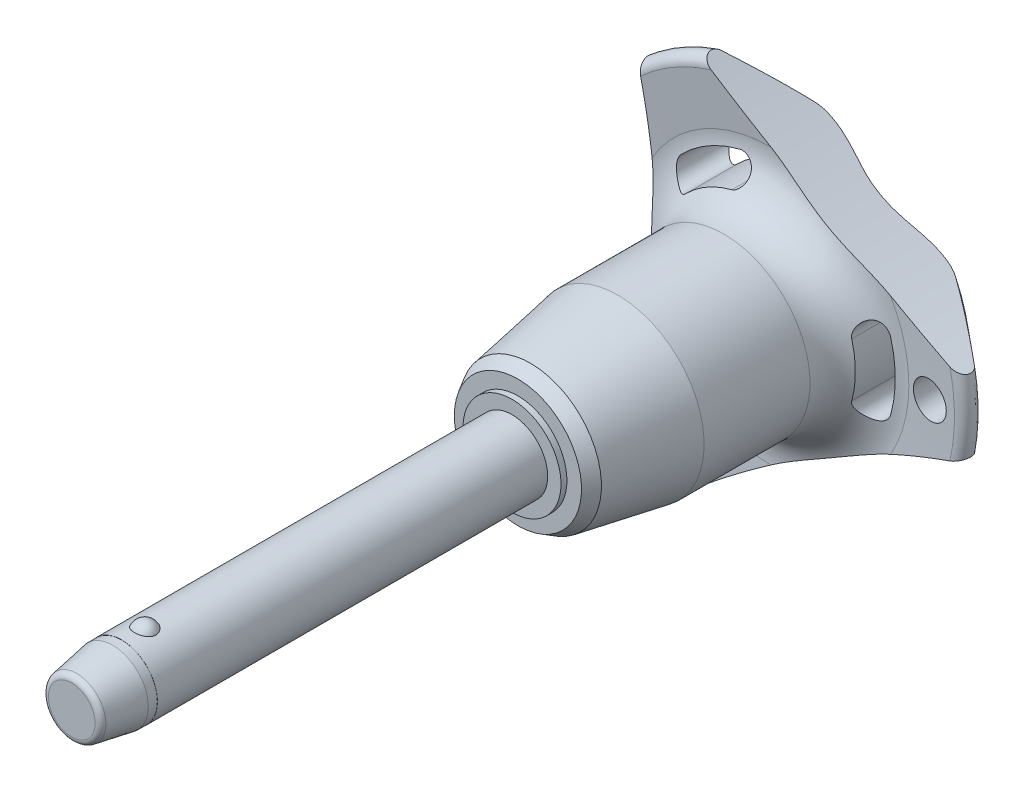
from build123d import *

# Parameters (mm, degrees)
SKETCH1_R           = 3
BOSS_EXTRUDE1_DEPTH = 30
SKETCH2_R           = 2.5
BOSS_EXTRUDE2_DEPTH = 26.7
BOSS_EXTRUDE3_START = 7
SKETCH1_2_R         = 3
BOSS_EXTRUDE3_DEPTH = 7
CHAMFER1_SIZE       = 3.5
CHAMFER1_SIZE2      = 0.617144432
FILLET1_R           = 0.5
SKETCH6_R           = 79.96
CUT_EXTRUDE1_DEPTH  = 62.368512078
CIRPATTERN1_COUNT   = 3
SKETCH7_R           = 1.5
CUT_EXTRUDE2_DEPTH  = 62.119983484
SKETCH8_R           = 3
SKETCH8_R_2         = 2.99
CUT_EXTRUDE3_DEPTH  = 4.2


with BuildPart() as part:
    # Sketch1 → Boss-Extrude1 (new body)
    with BuildSketch(Plane.XY):
        Circle(SKETCH1_R)
    extrude(amount=-BOSS_EXTRUDE1_DEPTH)

    # Sketch2 → Boss-Extrude2 (add)
    with BuildSketch(Plane(origin=(0, 0, -30), x_dir=(-1, 0, 0), z_dir=(0, 0, -1))):
        Circle(SKETCH2_R)
    extrude(amount=BOSS_EXTRUDE2_DEPTH)

    # Sketch3 → Revolve1 (revolve)
    with BuildSketch(Plane(origin=(0, 0, 0), x_dir=(0, 0, -1), z_dir=(1, 0, 0))):
        with BuildLine():
            Line((-0.866025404, 3.5), (-0.866025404, 1.5))
            ThreePointArc((-0.866025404, 1.5), (0.133974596, 2.5), (-0.866025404, 3.5))
        make_face()
        with BuildLine():
            Line((-0.866025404, -1.5), (-0.866025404, -3.5))
            ThreePointArc((-0.866025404, -3.5), (0.133974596, -2.5), (-0.866025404, -1.5))
        make_face()
    revolve(axis=Axis((0, -1.5, 0.866025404), (0, 1, 0)))

    # Sketch1_2 → Boss-Extrude3 (add)
    with BuildSketch(Plane.XY.offset(BOSS_EXTRUDE3_START)):
        Circle(SKETCH1_2_R)
    extrude(amount=-BOSS_EXTRUDE3_DEPTH)

    # Chamfer1
    chamfer1_edges = [part.edges().sort_by_distance(p)[0] for p in [
        (-3, 0, 7),
    ]]
    chamfer1_side = [part.faces().sort_by_distance(p)[0] for p in [
        (-3, 0, -11.5),
    ]]
    chamfer(chamfer1_edges, length=CHAMFER1_SIZE, length2=CHAMFER1_SIZE2, reference=chamfer1_side[0])

    # Fillet1
    fillet1_edges = [part.edges().sort_by_distance(p)[0] for p in [
        (-2.382855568, 0, 7),
        (2.5, 0, -56.7),
    ]]
    fillet(fillet1_edges, radius=FILLET1_R)

    # Sketch4 → Revolve2 (revolve)
    with BuildSketch(Plane(origin=(0, 0, 0), x_dir=(0, 0, -1), z_dir=(1, 0, 0)), mode=Mode.PRIVATE) as revolve2_sk:
        Polygon((30, 0), (30, 4.118359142), (30.5, 4.118359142), (30.5, 5.343400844), (31.560917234, 5.955921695), (38.9, 7.25), (47.8, 7.25), (47.8, 0), align=None)
    revolve(revolve2_sk.sketch.rotate(Axis((0, 0, -47.8), (0, 0, 1)), 90), axis=Axis((0, 0, -47.8), (0, 0, 1)))

    # Sketch5 → Revolve3 (revolve)
    with BuildSketch(Plane(origin=(0, 0, 0), x_dir=(0, 0, -1), z_dir=(1, 0, 0)), mode=Mode.PRIVATE) as revolve3_sk:
        with BuildLine():
            Line((51.78715932, 11.570250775), (51.452568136, 15.735949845))
            ThreePointArc((51.452568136, 15.735949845), (51.946485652, 16.540188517), (52.862835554, 16.314230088))
            Line((52.862835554, 16.314230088), (56.326414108, 12.186497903))
            ThreePointArc((56.326414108, 12.186497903), (56.7, 11.109282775), (56.261488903, 10.056825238))
            ThreePointArc((56.261488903, 10.056825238), (53.289873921, 5.413681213), (52.25, 0))
            Line((52.25, 0), (47.8, 0))
            Line((47.8, 0), (47.8, 7.25))
            ThreePointArc((47.8, 7.25), (50.739473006, 8.537160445), (51.78715932, 11.570250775))
        make_face()
    revolve(revolve3_sk.sketch.rotate(Axis((0, 0, -52.25), (0, 0, 1)), 90), axis=Axis((0, 0, -52.25), (0, 0, 1)))

    # Sketch6 → Cut-Extrude1 (cut, through all)
    with BuildSketch(Plane.XY):
        with Locations((-89.76, 0)):
            Circle(SKETCH6_R)
        with BuildLine():
            ThreePointArc((10.099921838, -2.834717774), (10.490188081, 0), (10.099921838, 2.834717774))
            ThreePointArc((10.099921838, 2.834717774), (8.768180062, 3.582738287), (8.020159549, 2.250996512))
            ThreePointArc((8.020159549, 2.250996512), (8.330062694, 0), (8.020159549, -2.250996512))
            ThreePointArc((8.020159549, -2.250996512), (8.768180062, -3.582738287), (10.099921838, -2.834717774))
        make_face()
    cut_extrude1 = extrude(amount=-CUT_EXTRUDE1_DEPTH, mode=Mode.SUBTRACT)

    # CirPattern1: Cut-Extrude1 ×3 about axis
    cirpattern1_axis = Axis((0, 0, 0), (0, 0, 1))
    for i in range(1, CIRPATTERN1_COUNT):
        add(cut_extrude1.rotate(cirpattern1_axis, i * 360 / CIRPATTERN1_COUNT), mode=Mode.SUBTRACT)

    # Sketch7 → Cut-Extrude2 (cut, through all)
    with BuildSketch(Plane.XY):
        with Locations(Location((13.490188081, 0, 0), (0, 0, 225.221865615))):
            Circle(SKETCH7_R)
    extrude(amount=-CUT_EXTRUDE2_DEPTH, mode=Mode.SUBTRACT)

    # Sketch8 → Cut-Extrude3 (cut)
    with BuildSketch(Plane.XY.offset(7)):
        Circle(SKETCH8_R)
        Circle(SKETCH8_R_2, mode=Mode.SUBTRACT)
    extrude(amount=-CUT_EXTRUDE3_DEPTH, mode=Mode.SUBTRACT)


solid = part.part
